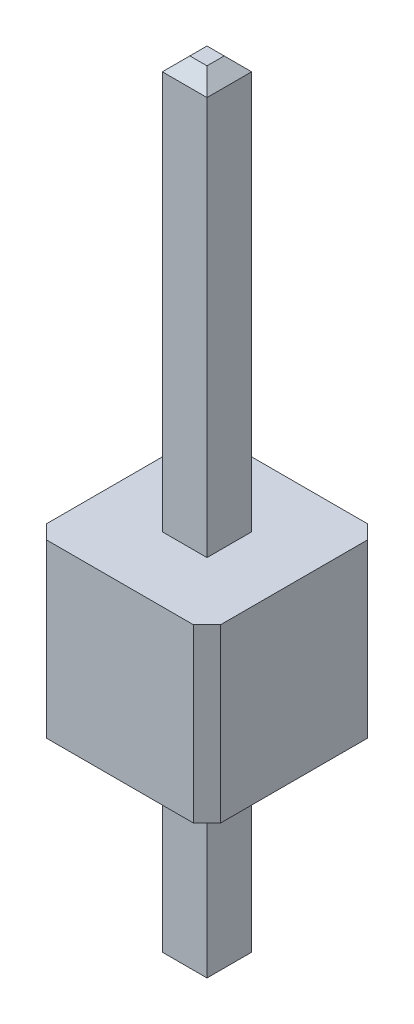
ISO-10303-21;
HEADER;
FILE_DESCRIPTION(('STEP AP214'),'2;1');
FILE_NAME('part.step','',(''),(''),'','','');
FILE_SCHEMA(('AUTOMOTIVE_DESIGN { 1 0 10303 214 1 1 1 1 }'));
ENDSEC;
DATA;
#1=APPLICATION_CONTEXT('core data for automotive mechanical design processes');
#2=APPLICATION_PROTOCOL_DEFINITION('international standard','automotive_design',2000,#1);
#3=PRODUCT_CONTEXT('',#1,'mechanical');
#4=PRODUCT('Part','Part','',(#3));
#5=PRODUCT_RELATED_PRODUCT_CATEGORY('part','',(#4));
#6=PRODUCT_DEFINITION_FORMATION('','',#4);
#7=PRODUCT_DEFINITION_CONTEXT('part definition',#1,'design');
#8=PRODUCT_DEFINITION('design','',#6,#7);
#9=PRODUCT_DEFINITION_SHAPE('','',#8);
#10=(LENGTH_UNIT() NAMED_UNIT(*) SI_UNIT(.MILLI.,.METRE.));
#11=(NAMED_UNIT(*) PLANE_ANGLE_UNIT() SI_UNIT($,.RADIAN.));
#12=(NAMED_UNIT(*) SI_UNIT($,.STERADIAN.) SOLID_ANGLE_UNIT());
#13=UNCERTAINTY_MEASURE_WITH_UNIT(LENGTH_MEASURE(1.E-05),#10,'distance_accuracy_value','');
#14=(GEOMETRIC_REPRESENTATION_CONTEXT(3) GLOBAL_UNCERTAINTY_ASSIGNED_CONTEXT((#13)) GLOBAL_UNIT_ASSIGNED_CONTEXT((#10,
#11,#12)) REPRESENTATION_CONTEXT('',''));
#15=CARTESIAN_POINT('',(0.,0.,0.));
#16=DIRECTION('',(0.,0.,1.));
#17=DIRECTION('',(1.,0.,0.));
#18=AXIS2_PLACEMENT_3D('',#15,#16,#17);
#19=CARTESIAN_POINT('',(1.27,2.5,1.27));
#20=DIRECTION('',(-1.,0.,0.));
#21=DIRECTION('',(0.,0.,1.));
#22=AXIS2_PLACEMENT_3D('',#19,#20,#21);
#23=PLANE('',#22);
#24=DIRECTION('',(0.,0.,-1.));
#25=VECTOR('',#24,1.);
#26=CARTESIAN_POINT('',(1.27,0.,1.27));
#27=LINE('',#26,#25);
#28=CARTESIAN_POINT('',(1.27,0.,1.07));
#29=VERTEX_POINT('',#28);
#30=CARTESIAN_POINT('',(1.27,0.,-1.07));
#31=VERTEX_POINT('',#30);
#32=EDGE_CURVE('E196',#29,#31,#27,.T.);
#33=ORIENTED_EDGE('',*,*,#32,.T.);
#34=DIRECTION('',(0.,1.,0.));
#35=VECTOR('',#34,1.);
#36=CARTESIAN_POINT('',(1.27,2.5,-1.07));
#37=LINE('',#36,#35);
#38=CARTESIAN_POINT('',(1.27,2.5,-1.07));
#39=VERTEX_POINT('',#38);
#40=EDGE_CURVE('E261',#31,#39,#37,.T.);
#41=ORIENTED_EDGE('',*,*,#40,.T.);
#42=DIRECTION('',(0.,0.,-1.));
#43=VECTOR('',#42,1.);
#44=CARTESIAN_POINT('',(1.27,2.5,1.27));
#45=LINE('',#44,#43);
#46=CARTESIAN_POINT('',(1.27,2.5,1.07));
#47=VERTEX_POINT('',#46);
#48=EDGE_CURVE('E197',#47,#39,#45,.T.);
#49=ORIENTED_EDGE('',*,*,#48,.F.);
#50=DIRECTION('',(0.,-1.,0.));
#51=VECTOR('',#50,1.);
#52=CARTESIAN_POINT('',(1.27,2.5,1.07));
#53=LINE('',#52,#51);
#54=EDGE_CURVE('E258',#47,#29,#53,.T.);
#55=ORIENTED_EDGE('',*,*,#54,.T.);
#56=EDGE_LOOP('',(#33,#41,#49,#55));
#57=FACE_BOUND('',#56,.T.);
#58=ADVANCED_FACE('F33',(#57),#23,.F.);
#59=CARTESIAN_POINT('',(-1.27,2.5,-1.27));
#60=DIRECTION('',(0.,0.,1.));
#61=DIRECTION('',(1.,0.,0.));
#62=AXIS2_PLACEMENT_3D('',#59,#60,#61);
#63=PLANE('',#62);
#64=DIRECTION('',(-1.,0.,0.));
#65=VECTOR('',#64,1.);
#66=CARTESIAN_POINT('',(-1.27,0.,-1.27));
#67=LINE('',#66,#65);
#68=CARTESIAN_POINT('',(1.07,0.,-1.27));
#69=VERTEX_POINT('',#68);
#70=CARTESIAN_POINT('',(-1.07,0.,-1.27));
#71=VERTEX_POINT('',#70);
#72=EDGE_CURVE('E213',#69,#71,#67,.T.);
#73=ORIENTED_EDGE('',*,*,#72,.T.);
#74=DIRECTION('',(0.,1.,0.));
#75=VECTOR('',#74,1.);
#76=CARTESIAN_POINT('',(-1.07,2.5,-1.27));
#77=LINE('',#76,#75);
#78=CARTESIAN_POINT('',(-1.07,2.5,-1.27));
#79=VERTEX_POINT('',#78);
#80=EDGE_CURVE('E248',#71,#79,#77,.T.);
#81=ORIENTED_EDGE('',*,*,#80,.T.);
#82=DIRECTION('',(-1.,0.,0.));
#83=VECTOR('',#82,1.);
#84=CARTESIAN_POINT('',(-1.27,2.5,-1.27));
#85=LINE('',#84,#83);
#86=CARTESIAN_POINT('',(1.07,2.5,-1.27));
#87=VERTEX_POINT('',#86);
#88=EDGE_CURVE('E200',#87,#79,#85,.T.);
#89=ORIENTED_EDGE('',*,*,#88,.F.);
#90=DIRECTION('',(0.,-1.,0.));
#91=VECTOR('',#90,1.);
#92=CARTESIAN_POINT('',(1.07,2.5,-1.27));
#93=LINE('',#92,#91);
#94=EDGE_CURVE('E245',#87,#69,#93,.T.);
#95=ORIENTED_EDGE('',*,*,#94,.T.);
#96=EDGE_LOOP('',(#73,#81,#89,#95));
#97=FACE_BOUND('',#96,.T.);
#98=ADVANCED_FACE('F358',(#97),#63,.F.);
#99=CARTESIAN_POINT('',(-1.27,2.5,1.27));
#100=DIRECTION('',(1.,0.,0.));
#101=DIRECTION('',(0.,0.,-1.));
#102=AXIS2_PLACEMENT_3D('',#99,#100,#101);
#103=PLANE('',#102);
#104=DIRECTION('',(0.,0.,1.));
#105=VECTOR('',#104,1.);
#106=CARTESIAN_POINT('',(-1.27,2.5,1.27));
#107=LINE('',#106,#105);
#108=CARTESIAN_POINT('',(-1.27,2.5,-1.07));
#109=VERTEX_POINT('',#108);
#110=CARTESIAN_POINT('',(-1.27,2.5,1.07));
#111=VERTEX_POINT('',#110);
#112=EDGE_CURVE('E204',#109,#111,#107,.T.);
#113=ORIENTED_EDGE('',*,*,#112,.F.);
#114=DIRECTION('',(0.,-1.,0.));
#115=VECTOR('',#114,1.);
#116=CARTESIAN_POINT('',(-1.27,2.5,-1.07));
#117=LINE('',#116,#115);
#118=CARTESIAN_POINT('',(-1.27,0.,-1.07));
#119=VERTEX_POINT('',#118);
#120=EDGE_CURVE('E234',#109,#119,#117,.T.);
#121=ORIENTED_EDGE('',*,*,#120,.T.);
#122=DIRECTION('',(0.,0.,1.));
#123=VECTOR('',#122,1.);
#124=CARTESIAN_POINT('',(-1.27,0.,1.27));
#125=LINE('',#124,#123);
#126=CARTESIAN_POINT('',(-1.27,0.,1.07));
#127=VERTEX_POINT('',#126);
#128=EDGE_CURVE('E216',#119,#127,#125,.T.);
#129=ORIENTED_EDGE('',*,*,#128,.T.);
#130=DIRECTION('',(0.,1.,0.));
#131=VECTOR('',#130,1.);
#132=CARTESIAN_POINT('',(-1.27,2.5,1.07));
#133=LINE('',#132,#131);
#134=EDGE_CURVE('E232',#127,#111,#133,.T.);
#135=ORIENTED_EDGE('',*,*,#134,.T.);
#136=EDGE_LOOP('',(#113,#121,#129,#135));
#137=FACE_BOUND('',#136,.T.);
#138=ADVANCED_FACE('F364',(#137),#103,.F.);
#139=CARTESIAN_POINT('',(-1.27,2.5,1.27));
#140=DIRECTION('',(0.,0.,-1.));
#141=DIRECTION('',(-1.,0.,0.));
#142=AXIS2_PLACEMENT_3D('',#139,#140,#141);
#143=PLANE('',#142);
#144=DIRECTION('',(1.,0.,0.));
#145=VECTOR('',#144,1.);
#146=CARTESIAN_POINT('',(-1.27,2.5,1.27));
#147=LINE('',#146,#145);
#148=CARTESIAN_POINT('',(-1.07,2.5,1.27));
#149=VERTEX_POINT('',#148);
#150=CARTESIAN_POINT('',(1.07,2.5,1.27));
#151=VERTEX_POINT('',#150);
#152=EDGE_CURVE('E207',#149,#151,#147,.T.);
#153=ORIENTED_EDGE('',*,*,#152,.F.);
#154=DIRECTION('',(0.,-1.,0.));
#155=VECTOR('',#154,1.);
#156=CARTESIAN_POINT('',(-1.07,2.5,1.27));
#157=LINE('',#156,#155);
#158=CARTESIAN_POINT('',(-1.07,0.,1.27));
#159=VERTEX_POINT('',#158);
#160=EDGE_CURVE('E265',#149,#159,#157,.T.);
#161=ORIENTED_EDGE('',*,*,#160,.T.);
#162=DIRECTION('',(1.,0.,0.));
#163=VECTOR('',#162,1.);
#164=CARTESIAN_POINT('',(-1.27,0.,1.27));
#165=LINE('',#164,#163);
#166=CARTESIAN_POINT('',(1.07,0.,1.27));
#167=VERTEX_POINT('',#166);
#168=EDGE_CURVE('E201',#159,#167,#165,.T.);
#169=ORIENTED_EDGE('',*,*,#168,.T.);
#170=DIRECTION('',(0.,1.,0.));
#171=VECTOR('',#170,1.);
#172=CARTESIAN_POINT('',(1.07,2.5,1.27));
#173=LINE('',#172,#171);
#174=EDGE_CURVE('E263',#167,#151,#173,.T.);
#175=ORIENTED_EDGE('',*,*,#174,.T.);
#176=EDGE_LOOP('',(#153,#161,#169,#175));
#177=FACE_BOUND('',#176,.T.);
#178=ADVANCED_FACE('F461',(#177),#143,.F.);
#179=CARTESIAN_POINT('',(0.,2.5,0.));
#180=DIRECTION('',(0.,-1.,0.));
#181=DIRECTION('',(0.,0.,-1.));
#182=AXIS2_PLACEMENT_3D('',#179,#180,#181);
#183=PLANE('',#182);
#184=DIRECTION('',(1.,0.,0.));
#185=VECTOR('',#184,1.);
#186=CARTESIAN_POINT('',(0.,2.5,-0.325));
#187=LINE('',#186,#185);
#188=CARTESIAN_POINT('',(-0.325,2.5,-0.325));
#189=VERTEX_POINT('',#188);
#190=CARTESIAN_POINT('',(0.325,2.5,-0.325));
#191=VERTEX_POINT('',#190);
#192=EDGE_CURVE('E170',#189,#191,#187,.T.);
#193=ORIENTED_EDGE('',*,*,#192,.T.);
#194=DIRECTION('',(0.,0.,1.));
#195=VECTOR('',#194,1.);
#196=CARTESIAN_POINT('',(0.325,2.5,0.));
#197=LINE('',#196,#195);
#198=CARTESIAN_POINT('',(0.325,2.5,0.325));
#199=VERTEX_POINT('',#198);
#200=EDGE_CURVE('E191',#191,#199,#197,.T.);
#201=ORIENTED_EDGE('',*,*,#200,.T.);
#202=DIRECTION('',(-1.,0.,0.));
#203=VECTOR('',#202,1.);
#204=CARTESIAN_POINT('',(0.,2.5,0.325));
#205=LINE('',#204,#203);
#206=CARTESIAN_POINT('',(-0.325,2.5,0.325));
#207=VERTEX_POINT('',#206);
#208=EDGE_CURVE('E189',#199,#207,#205,.T.);
#209=ORIENTED_EDGE('',*,*,#208,.T.);
#210=DIRECTION('',(0.,0.,-1.));
#211=VECTOR('',#210,1.);
#212=CARTESIAN_POINT('',(-0.325,2.5,0.));
#213=LINE('',#212,#211);
#214=EDGE_CURVE('E178',#207,#189,#213,.T.);
#215=ORIENTED_EDGE('',*,*,#214,.T.);
#216=EDGE_LOOP('',(#193,#201,#209,#215));
#217=FACE_BOUND('',#216,.T.);
#218=ORIENTED_EDGE('',*,*,#88,.T.);
#219=DIRECTION('',(0.707106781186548,0.,-0.707106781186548));
#220=VECTOR('',#219,1.);
#221=CARTESIAN_POINT('',(-1.27,2.5,-1.07));
#222=LINE('',#221,#220);
#223=EDGE_CURVE('E256',#79,#109,#222,.F.);
#224=ORIENTED_EDGE('',*,*,#223,.T.);
#225=ORIENTED_EDGE('',*,*,#112,.T.);
#226=DIRECTION('',(-0.707106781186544,0.,-0.707106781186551));
#227=VECTOR('',#226,1.);
#228=CARTESIAN_POINT('',(-1.07,2.5,1.27));
#229=LINE('',#228,#227);
#230=EDGE_CURVE('E252',#111,#149,#229,.F.);
#231=ORIENTED_EDGE('',*,*,#230,.T.);
#232=ORIENTED_EDGE('',*,*,#152,.T.);
#233=DIRECTION('',(-0.707106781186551,0.,0.707106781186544));
#234=VECTOR('',#233,1.);
#235=CARTESIAN_POINT('',(1.27,2.5,1.07));
#236=LINE('',#235,#234);
#237=EDGE_CURVE('E250',#151,#47,#236,.F.);
#238=ORIENTED_EDGE('',*,*,#237,.T.);
#239=ORIENTED_EDGE('',*,*,#48,.T.);
#240=DIRECTION('',(0.707106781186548,0.,0.707106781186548));
#241=VECTOR('',#240,1.);
#242=CARTESIAN_POINT('',(1.07,2.5,-1.27));
#243=LINE('',#242,#241);
#244=EDGE_CURVE('E254',#39,#87,#243,.F.);
#245=ORIENTED_EDGE('',*,*,#244,.T.);
#246=EDGE_LOOP('',(#218,#224,#225,#231,#232,#238,#239,#245));
#247=FACE_BOUND('',#246,.T.);
#248=ADVANCED_FACE('F187',(#217,#247),#183,.F.);
#249=CARTESIAN_POINT('',(0.,0.,0.));
#250=DIRECTION('',(0.,-1.,0.));
#251=DIRECTION('',(0.,0.,-1.));
#252=AXIS2_PLACEMENT_3D('',#249,#250,#251);
#253=PLANE('',#252);
#254=DIRECTION('',(0.,0.,1.));
#255=VECTOR('',#254,1.);
#256=CARTESIAN_POINT('',(0.325,0.,0.));
#257=LINE('',#256,#255);
#258=CARTESIAN_POINT('',(0.325,0.,-0.325));
#259=VERTEX_POINT('',#258);
#260=CARTESIAN_POINT('',(0.325,0.,0.325));
#261=VERTEX_POINT('',#260);
#262=EDGE_CURVE('E229',#259,#261,#257,.T.);
#263=ORIENTED_EDGE('',*,*,#262,.F.);
#264=DIRECTION('',(1.,0.,0.));
#265=VECTOR('',#264,1.);
#266=CARTESIAN_POINT('',(0.,0.,-0.325));
#267=LINE('',#266,#265);
#268=CARTESIAN_POINT('',(-0.325,0.,-0.325));
#269=VERTEX_POINT('',#268);
#270=EDGE_CURVE('E210',#269,#259,#267,.T.);
#271=ORIENTED_EDGE('',*,*,#270,.F.);
#272=DIRECTION('',(0.,0.,-1.));
#273=VECTOR('',#272,1.);
#274=CARTESIAN_POINT('',(-0.325,0.,0.));
#275=LINE('',#274,#273);
#276=CARTESIAN_POINT('',(-0.325,0.,0.325));
#277=VERTEX_POINT('',#276);
#278=EDGE_CURVE('E223',#277,#269,#275,.T.);
#279=ORIENTED_EDGE('',*,*,#278,.F.);
#280=DIRECTION('',(-1.,0.,0.));
#281=VECTOR('',#280,1.);
#282=CARTESIAN_POINT('',(0.,0.,0.325));
#283=LINE('',#282,#281);
#284=EDGE_CURVE('E226',#261,#277,#283,.T.);
#285=ORIENTED_EDGE('',*,*,#284,.F.);
#286=EDGE_LOOP('',(#263,#271,#279,#285));
#287=FACE_BOUND('',#286,.T.);
#288=ORIENTED_EDGE('',*,*,#128,.F.);
#289=DIRECTION('',(-0.707106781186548,0.,0.707106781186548));
#290=VECTOR('',#289,1.);
#291=CARTESIAN_POINT('',(-1.17,0.,-1.17));
#292=LINE('',#291,#290);
#293=EDGE_CURVE('E243',#119,#71,#292,.F.);
#294=ORIENTED_EDGE('',*,*,#293,.T.);
#295=ORIENTED_EDGE('',*,*,#72,.F.);
#296=DIRECTION('',(-0.707106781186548,0.,-0.707106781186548));
#297=VECTOR('',#296,1.);
#298=CARTESIAN_POINT('',(1.17,0.,-1.17));
#299=LINE('',#298,#297);
#300=EDGE_CURVE('E241',#69,#31,#299,.F.);
#301=ORIENTED_EDGE('',*,*,#300,.T.);
#302=ORIENTED_EDGE('',*,*,#32,.F.);
#303=DIRECTION('',(0.707106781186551,0.,-0.707106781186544));
#304=VECTOR('',#303,1.);
#305=CARTESIAN_POINT('',(1.16999999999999,0.,1.17));
#306=LINE('',#305,#304);
#307=EDGE_CURVE('E237',#29,#167,#306,.F.);
#308=ORIENTED_EDGE('',*,*,#307,.T.);
#309=ORIENTED_EDGE('',*,*,#168,.F.);
#310=DIRECTION('',(0.707106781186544,0.,0.707106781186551));
#311=VECTOR('',#310,1.);
#312=CARTESIAN_POINT('',(-1.17,0.,1.16999999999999));
#313=LINE('',#312,#311);
#314=EDGE_CURVE('E239',#159,#127,#313,.F.);
#315=ORIENTED_EDGE('',*,*,#314,.T.);
#316=EDGE_LOOP('',(#288,#294,#295,#301,#302,#308,#309,#315));
#317=FACE_BOUND('',#316,.T.);
#318=ADVANCED_FACE('F444',(#287,#317),#253,.T.);
#319=CARTESIAN_POINT('',(0.,-3.,0.));
#320=DIRECTION('',(0.,-1.,0.));
#321=DIRECTION('',(0.,0.,-1.));
#322=AXIS2_PLACEMENT_3D('',#319,#320,#321);
#323=PLANE('',#322);
#324=DIRECTION('',(0.,0.,1.));
#325=VECTOR('',#324,1.);
#326=CARTESIAN_POINT('',(0.125,-3.,0.));
#327=LINE('',#326,#325);
#328=CARTESIAN_POINT('',(0.125,-3.,-0.125));
#329=VERTEX_POINT('',#328);
#330=CARTESIAN_POINT('',(0.125,-3.,0.124999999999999));
#331=VERTEX_POINT('',#330);
#332=EDGE_CURVE('E271',#329,#331,#327,.T.);
#333=ORIENTED_EDGE('',*,*,#332,.T.);
#334=DIRECTION('',(-1.,0.,0.));
#335=VECTOR('',#334,1.);
#336=CARTESIAN_POINT('',(0.,-3.,0.124999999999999));
#337=LINE('',#336,#335);
#338=CARTESIAN_POINT('',(-0.124999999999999,-3.,0.124999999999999));
#339=VERTEX_POINT('',#338);
#340=EDGE_CURVE('E277',#331,#339,#337,.T.);
#341=ORIENTED_EDGE('',*,*,#340,.T.);
#342=DIRECTION('',(0.,0.,-1.));
#343=VECTOR('',#342,1.);
#344=CARTESIAN_POINT('',(-0.124999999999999,-3.,0.));
#345=LINE('',#344,#343);
#346=CARTESIAN_POINT('',(-0.124999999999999,-3.,-0.125));
#347=VERTEX_POINT('',#346);
#348=EDGE_CURVE('E275',#339,#347,#345,.T.);
#349=ORIENTED_EDGE('',*,*,#348,.T.);
#350=DIRECTION('',(1.,0.,0.));
#351=VECTOR('',#350,1.);
#352=CARTESIAN_POINT('',(0.,-3.,-0.125));
#353=LINE('',#352,#351);
#354=EDGE_CURVE('E273',#347,#329,#353,.T.);
#355=ORIENTED_EDGE('',*,*,#354,.T.);
#356=EDGE_LOOP('',(#333,#341,#349,#355));
#357=FACE_BOUND('',#356,.T.);
#358=ADVANCED_FACE('F449',(#357),#323,.T.);
#359=CARTESIAN_POINT('',(-0.325,-3.,-0.325));
#360=DIRECTION('',(0.,0.,-1.));
#361=DIRECTION('',(-1.,0.,0.));
#362=AXIS2_PLACEMENT_3D('',#359,#360,#361);
#363=PLANE('',#362);
#364=DIRECTION('',(0.,1.,0.));
#365=VECTOR('',#364,1.);
#366=CARTESIAN_POINT('',(0.325,-3.,-0.325));
#367=LINE('',#366,#365);
#368=CARTESIAN_POINT('',(0.325,-2.8,-0.325));
#369=VERTEX_POINT('',#368);
#370=EDGE_CURVE('E184',#369,#259,#367,.T.);
#371=ORIENTED_EDGE('',*,*,#370,.F.);
#372=DIRECTION('',(-1.,0.,0.));
#373=VECTOR('',#372,1.);
#374=CARTESIAN_POINT('',(-0.325,-2.8,-0.325));
#375=LINE('',#374,#373);
#376=CARTESIAN_POINT('',(-0.325,-2.8,-0.325));
#377=VERTEX_POINT('',#376);
#378=EDGE_CURVE('E282',#369,#377,#375,.T.);
#379=ORIENTED_EDGE('',*,*,#378,.T.);
#380=DIRECTION('',(0.,1.,0.));
#381=VECTOR('',#380,1.);
#382=CARTESIAN_POINT('',(-0.325,-3.,-0.325));
#383=LINE('',#382,#381);
#384=EDGE_CURVE('E183',#377,#269,#383,.T.);
#385=ORIENTED_EDGE('',*,*,#384,.T.);
#386=ORIENTED_EDGE('',*,*,#270,.T.);
#387=EDGE_LOOP('',(#371,#379,#385,#386));
#388=FACE_BOUND('',#387,.T.);
#389=ADVANCED_FACE('F355',(#388),#363,.T.);
#390=CARTESIAN_POINT('',(-0.325,-3.,0.325));
#391=DIRECTION('',(-1.,0.,0.));
#392=DIRECTION('',(0.,0.,1.));
#393=AXIS2_PLACEMENT_3D('',#390,#391,#392);
#394=PLANE('',#393);
#395=ORIENTED_EDGE('',*,*,#384,.F.);
#396=DIRECTION('',(0.,0.,1.));
#397=VECTOR('',#396,1.);
#398=CARTESIAN_POINT('',(-0.325,-2.8,0.325));
#399=LINE('',#398,#397);
#400=CARTESIAN_POINT('',(-0.325,-2.8,0.325));
#401=VERTEX_POINT('',#400);
#402=EDGE_CURVE('E280',#377,#401,#399,.T.);
#403=ORIENTED_EDGE('',*,*,#402,.T.);
#404=DIRECTION('',(0.,1.,0.));
#405=VECTOR('',#404,1.);
#406=CARTESIAN_POINT('',(-0.325,-3.,0.325));
#407=LINE('',#406,#405);
#408=EDGE_CURVE('E337',#401,#277,#407,.T.);
#409=ORIENTED_EDGE('',*,*,#408,.T.);
#410=ORIENTED_EDGE('',*,*,#278,.T.);
#411=EDGE_LOOP('',(#395,#403,#409,#410));
#412=FACE_BOUND('',#411,.T.);
#413=ADVANCED_FACE('F500',(#412),#394,.T.);
#414=CARTESIAN_POINT('',(-0.325,-3.,0.325));
#415=DIRECTION('',(0.,0.,1.));
#416=DIRECTION('',(1.,0.,0.));
#417=AXIS2_PLACEMENT_3D('',#414,#415,#416);
#418=PLANE('',#417);
#419=ORIENTED_EDGE('',*,*,#408,.F.);
#420=DIRECTION('',(1.,0.,0.));
#421=VECTOR('',#420,1.);
#422=CARTESIAN_POINT('',(-0.325,-2.8,0.325));
#423=LINE('',#422,#421);
#424=CARTESIAN_POINT('',(0.325,-2.8,0.325));
#425=VERTEX_POINT('',#424);
#426=EDGE_CURVE('E268',#401,#425,#423,.T.);
#427=ORIENTED_EDGE('',*,*,#426,.T.);
#428=DIRECTION('',(0.,1.,0.));
#429=VECTOR('',#428,1.);
#430=CARTESIAN_POINT('',(0.325,-3.,0.325));
#431=LINE('',#430,#429);
#432=EDGE_CURVE('E179',#425,#261,#431,.T.);
#433=ORIENTED_EDGE('',*,*,#432,.T.);
#434=ORIENTED_EDGE('',*,*,#284,.T.);
#435=EDGE_LOOP('',(#419,#427,#433,#434));
#436=FACE_BOUND('',#435,.T.);
#437=ADVANCED_FACE('F496',(#436),#418,.T.);
#438=CARTESIAN_POINT('',(0.325,-3.,0.325));
#439=DIRECTION('',(1.,0.,0.));
#440=DIRECTION('',(0.,0.,-1.));
#441=AXIS2_PLACEMENT_3D('',#438,#439,#440);
#442=PLANE('',#441);
#443=ORIENTED_EDGE('',*,*,#432,.F.);
#444=DIRECTION('',(0.,0.,-1.));
#445=VECTOR('',#444,1.);
#446=CARTESIAN_POINT('',(0.325,-2.8,0.325));
#447=LINE('',#446,#445);
#448=EDGE_CURVE('E284',#425,#369,#447,.T.);
#449=ORIENTED_EDGE('',*,*,#448,.T.);
#450=ORIENTED_EDGE('',*,*,#370,.T.);
#451=ORIENTED_EDGE('',*,*,#262,.T.);
#452=EDGE_LOOP('',(#443,#449,#450,#451));
#453=FACE_BOUND('',#452,.T.);
#454=ADVANCED_FACE('F494',(#453),#442,.T.);
#455=CARTESIAN_POINT('',(0.325,8.3,-0.325));
#456=VERTEX_POINT('',#455);
#457=EDGE_CURVE('E173',#191,#456,#367,.T.);
#458=ORIENTED_EDGE('',*,*,#457,.T.);
#459=DIRECTION('',(0.,0.,1.));
#460=VECTOR('',#459,1.);
#461=CARTESIAN_POINT('',(0.325,8.3,0.325));
#462=LINE('',#461,#460);
#463=CARTESIAN_POINT('',(0.325,8.3,0.325));
#464=VERTEX_POINT('',#463);
#465=EDGE_CURVE('E11',#456,#464,#462,.T.);
#466=ORIENTED_EDGE('',*,*,#465,.T.);
#467=EDGE_CURVE('E333',#199,#464,#431,.T.);
#468=ORIENTED_EDGE('',*,*,#467,.F.);
#469=ORIENTED_EDGE('',*,*,#200,.F.);
#470=EDGE_LOOP('',(#458,#466,#468,#469));
#471=FACE_BOUND('',#470,.T.);
#472=ADVANCED_FACE('F332',(#471),#442,.T.);
#473=ORIENTED_EDGE('',*,*,#467,.T.);
#474=DIRECTION('',(-1.,0.,0.));
#475=VECTOR('',#474,1.);
#476=CARTESIAN_POINT('',(-0.325,8.3,0.325));
#477=LINE('',#476,#475);
#478=CARTESIAN_POINT('',(-0.325,8.3,0.325));
#479=VERTEX_POINT('',#478);
#480=EDGE_CURVE('E295',#464,#479,#477,.T.);
#481=ORIENTED_EDGE('',*,*,#480,.T.);
#482=EDGE_CURVE('E524',#207,#479,#407,.T.);
#483=ORIENTED_EDGE('',*,*,#482,.F.);
#484=ORIENTED_EDGE('',*,*,#208,.F.);
#485=EDGE_LOOP('',(#473,#481,#483,#484));
#486=FACE_BOUND('',#485,.T.);
#487=ADVANCED_FACE('F336',(#486),#418,.T.);
#488=ORIENTED_EDGE('',*,*,#482,.T.);
#489=DIRECTION('',(0.,0.,-1.));
#490=VECTOR('',#489,1.);
#491=CARTESIAN_POINT('',(-0.325,8.3,-0.325));
#492=LINE('',#491,#490);
#493=CARTESIAN_POINT('',(-0.325,8.3,-0.325));
#494=VERTEX_POINT('',#493);
#495=EDGE_CURVE('E57',#479,#494,#492,.T.);
#496=ORIENTED_EDGE('',*,*,#495,.T.);
#497=EDGE_CURVE('E172',#189,#494,#383,.T.);
#498=ORIENTED_EDGE('',*,*,#497,.F.);
#499=ORIENTED_EDGE('',*,*,#214,.F.);
#500=EDGE_LOOP('',(#488,#496,#498,#499));
#501=FACE_BOUND('',#500,.T.);
#502=ADVANCED_FACE('F181',(#501),#394,.T.);
#503=ORIENTED_EDGE('',*,*,#497,.T.);
#504=DIRECTION('',(1.,0.,0.));
#505=VECTOR('',#504,1.);
#506=CARTESIAN_POINT('',(0.325,8.3,-0.325));
#507=LINE('',#506,#505);
#508=EDGE_CURVE('E42',#494,#456,#507,.T.);
#509=ORIENTED_EDGE('',*,*,#508,.T.);
#510=ORIENTED_EDGE('',*,*,#457,.F.);
#511=ORIENTED_EDGE('',*,*,#192,.F.);
#512=EDGE_LOOP('',(#503,#509,#510,#511));
#513=FACE_BOUND('',#512,.T.);
#514=ADVANCED_FACE('F171',(#513),#363,.T.);
#515=CARTESIAN_POINT('',(0.,8.5,0.));
#516=DIRECTION('',(0.,-1.,0.));
#517=DIRECTION('',(0.,0.,-1.));
#518=AXIS2_PLACEMENT_3D('',#515,#516,#517);
#519=PLANE('',#518);
#520=DIRECTION('',(0.,0.,1.));
#521=VECTOR('',#520,1.);
#522=CARTESIAN_POINT('',(-0.124999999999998,8.5,0.325));
#523=LINE('',#522,#521);
#524=CARTESIAN_POINT('',(-0.124999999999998,8.5,-0.124999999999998));
#525=VERTEX_POINT('',#524);
#526=CARTESIAN_POINT('',(-0.124999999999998,8.5,0.124999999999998));
#527=VERTEX_POINT('',#526);
#528=EDGE_CURVE('E290',#525,#527,#523,.T.);
#529=ORIENTED_EDGE('',*,*,#528,.T.);
#530=DIRECTION('',(1.,0.,0.));
#531=VECTOR('',#530,1.);
#532=CARTESIAN_POINT('',(0.325,8.5,0.124999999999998));
#533=LINE('',#532,#531);
#534=CARTESIAN_POINT('',(0.124999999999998,8.5,0.124999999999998));
#535=VERTEX_POINT('',#534);
#536=EDGE_CURVE('E292',#527,#535,#533,.T.);
#537=ORIENTED_EDGE('',*,*,#536,.T.);
#538=DIRECTION('',(0.,0.,-1.));
#539=VECTOR('',#538,1.);
#540=CARTESIAN_POINT('',(0.124999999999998,8.5,-0.325));
#541=LINE('',#540,#539);
#542=CARTESIAN_POINT('',(0.124999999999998,8.5,-0.124999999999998));
#543=VERTEX_POINT('',#542);
#544=EDGE_CURVE('E286',#535,#543,#541,.T.);
#545=ORIENTED_EDGE('',*,*,#544,.T.);
#546=DIRECTION('',(-1.,0.,0.));
#547=VECTOR('',#546,1.);
#548=CARTESIAN_POINT('',(-0.325,8.5,-0.124999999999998));
#549=LINE('',#548,#547);
#550=EDGE_CURVE('E288',#543,#525,#549,.T.);
#551=ORIENTED_EDGE('',*,*,#550,.T.);
#552=EDGE_LOOP('',(#529,#537,#545,#551));
#553=FACE_BOUND('',#552,.T.);
#554=ADVANCED_FACE('F343',(#553),#519,.F.);
#555=CARTESIAN_POINT('',(-1.27,2.5,-1.07));
#556=DIRECTION('',(0.707106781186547,0.,0.707106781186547));
#557=DIRECTION('',(0.,-1.,0.));
#558=AXIS2_PLACEMENT_3D('',#555,#556,#557);
#559=PLANE('',#558);
#560=ORIENTED_EDGE('',*,*,#223,.F.);
#561=ORIENTED_EDGE('',*,*,#80,.F.);
#562=ORIENTED_EDGE('',*,*,#293,.F.);
#563=ORIENTED_EDGE('',*,*,#120,.F.);
#564=EDGE_LOOP('',(#560,#561,#562,#563));
#565=FACE_BOUND('',#564,.T.);
#566=ADVANCED_FACE('F345',(#565),#559,.F.);
#567=CARTESIAN_POINT('',(1.07,2.5,-1.27));
#568=DIRECTION('',(-0.707106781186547,0.,0.707106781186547));
#569=DIRECTION('',(0.,-1.,0.));
#570=AXIS2_PLACEMENT_3D('',#567,#568,#569);
#571=PLANE('',#570);
#572=ORIENTED_EDGE('',*,*,#244,.F.);
#573=ORIENTED_EDGE('',*,*,#40,.F.);
#574=ORIENTED_EDGE('',*,*,#300,.F.);
#575=ORIENTED_EDGE('',*,*,#94,.F.);
#576=EDGE_LOOP('',(#572,#573,#574,#575));
#577=FACE_BOUND('',#576,.T.);
#578=ADVANCED_FACE('F351',(#577),#571,.F.);
#579=CARTESIAN_POINT('',(-1.07,2.5,1.27));
#580=DIRECTION('',(0.707106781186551,0.,-0.707106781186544));
#581=DIRECTION('',(0.,-1.,0.));
#582=AXIS2_PLACEMENT_3D('',#579,#580,#581);
#583=PLANE('',#582);
#584=ORIENTED_EDGE('',*,*,#230,.F.);
#585=ORIENTED_EDGE('',*,*,#134,.F.);
#586=ORIENTED_EDGE('',*,*,#314,.F.);
#587=ORIENTED_EDGE('',*,*,#160,.F.);
#588=EDGE_LOOP('',(#584,#585,#586,#587));
#589=FACE_BOUND('',#588,.T.);
#590=ADVANCED_FACE('F371',(#589),#583,.F.);
#591=CARTESIAN_POINT('',(1.27,2.5,1.07));
#592=DIRECTION('',(-0.707106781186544,0.,-0.707106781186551));
#593=DIRECTION('',(0.,-1.,0.));
#594=AXIS2_PLACEMENT_3D('',#591,#592,#593);
#595=PLANE('',#594);
#596=ORIENTED_EDGE('',*,*,#237,.F.);
#597=ORIENTED_EDGE('',*,*,#174,.F.);
#598=ORIENTED_EDGE('',*,*,#307,.F.);
#599=ORIENTED_EDGE('',*,*,#54,.F.);
#600=EDGE_LOOP('',(#596,#597,#598,#599));
#601=FACE_BOUND('',#600,.T.);
#602=ADVANCED_FACE('F375',(#601),#595,.F.);
#603=CARTESIAN_POINT('',(-0.325,-2.8,-0.325));
#604=DIRECTION('',(0.,0.707106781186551,0.707106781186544));
#605=DIRECTION('',(-1.,0.,0.));
#606=AXIS2_PLACEMENT_3D('',#603,#604,#605);
#607=PLANE('',#606);
#608=DIRECTION('',(0.577350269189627,0.577350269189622,-0.577350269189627));
#609=VECTOR('',#608,1.);
#610=CARTESIAN_POINT('',(0.108333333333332,-3.01666666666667,-0.108333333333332));
#611=LINE('',#610,#609);
#612=EDGE_CURVE('E304',#329,#369,#611,.T.);
#613=ORIENTED_EDGE('',*,*,#612,.F.);
#614=ORIENTED_EDGE('',*,*,#354,.F.);
#615=DIRECTION('',(-0.577350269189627,0.577350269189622,-0.577350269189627));
#616=VECTOR('',#615,1.);
#617=CARTESIAN_POINT('',(-0.325,-2.8,-0.325));
#618=LINE('',#617,#616);
#619=EDGE_CURVE('E307',#377,#347,#618,.F.);
#620=ORIENTED_EDGE('',*,*,#619,.F.);
#621=ORIENTED_EDGE('',*,*,#378,.F.);
#622=EDGE_LOOP('',(#613,#614,#620,#621));
#623=FACE_BOUND('',#622,.T.);
#624=ADVANCED_FACE('F379',(#623),#607,.F.);
#625=CARTESIAN_POINT('',(-0.325,-2.8,0.325));
#626=DIRECTION('',(0.707106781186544,0.707106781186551,0.));
#627=DIRECTION('',(0.,0.,1.));
#628=AXIS2_PLACEMENT_3D('',#625,#626,#627);
#629=PLANE('',#628);
#630=ORIENTED_EDGE('',*,*,#619,.T.);
#631=ORIENTED_EDGE('',*,*,#348,.F.);
#632=DIRECTION('',(-0.577350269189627,0.577350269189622,0.577350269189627));
#633=VECTOR('',#632,1.);
#634=CARTESIAN_POINT('',(-0.325,-2.8,0.325));
#635=LINE('',#634,#633);
#636=EDGE_CURVE('E302',#401,#339,#635,.F.);
#637=ORIENTED_EDGE('',*,*,#636,.F.);
#638=ORIENTED_EDGE('',*,*,#402,.F.);
#639=EDGE_LOOP('',(#630,#631,#637,#638));
#640=FACE_BOUND('',#639,.T.);
#641=ADVANCED_FACE('F388',(#640),#629,.F.);
#642=CARTESIAN_POINT('',(0.325,-2.8,0.325));
#643=DIRECTION('',(-0.707106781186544,0.707106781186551,0.));
#644=DIRECTION('',(0.,0.,-1.));
#645=AXIS2_PLACEMENT_3D('',#642,#643,#644);
#646=PLANE('',#645);
#647=ORIENTED_EDGE('',*,*,#612,.T.);
#648=ORIENTED_EDGE('',*,*,#448,.F.);
#649=DIRECTION('',(-0.577350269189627,-0.577350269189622,-0.577350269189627));
#650=VECTOR('',#649,1.);
#651=CARTESIAN_POINT('',(0.325,-2.8,0.325));
#652=LINE('',#651,#650);
#653=EDGE_CURVE('E300',#331,#425,#652,.F.);
#654=ORIENTED_EDGE('',*,*,#653,.F.);
#655=ORIENTED_EDGE('',*,*,#332,.F.);
#656=EDGE_LOOP('',(#647,#648,#654,#655));
#657=FACE_BOUND('',#656,.T.);
#658=ADVANCED_FACE('F384',(#657),#646,.F.);
#659=CARTESIAN_POINT('',(-0.325,-2.8,0.325));
#660=DIRECTION('',(0.,0.707106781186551,-0.707106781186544));
#661=DIRECTION('',(1.,0.,0.));
#662=AXIS2_PLACEMENT_3D('',#659,#660,#661);
#663=PLANE('',#662);
#664=ORIENTED_EDGE('',*,*,#636,.T.);
#665=ORIENTED_EDGE('',*,*,#340,.F.);
#666=ORIENTED_EDGE('',*,*,#653,.T.);
#667=ORIENTED_EDGE('',*,*,#426,.F.);
#668=EDGE_LOOP('',(#664,#665,#666,#667));
#669=FACE_BOUND('',#668,.T.);
#670=ADVANCED_FACE('F381',(#669),#663,.F.);
#671=CARTESIAN_POINT('',(0.,8.5,-0.124999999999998));
#672=DIRECTION('',(0.,0.707106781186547,-0.707106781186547));
#673=DIRECTION('',(1.,0.,0.));
#674=AXIS2_PLACEMENT_3D('',#671,#672,#673);
#675=PLANE('',#674);
#676=DIRECTION('',(-0.577350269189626,0.577350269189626,0.577350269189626));
#677=VECTOR('',#676,1.);
#678=CARTESIAN_POINT('',(0.0833333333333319,8.54166666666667,-0.0833333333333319));
#679=LINE('',#678,#677);
#680=EDGE_CURVE('E313',#456,#543,#679,.T.);
#681=ORIENTED_EDGE('',*,*,#680,.F.);
#682=ORIENTED_EDGE('',*,*,#508,.F.);
#683=DIRECTION('',(0.577350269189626,0.577350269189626,0.577350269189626));
#684=VECTOR('',#683,1.);
#685=CARTESIAN_POINT('',(-0.0833333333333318,8.54166666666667,-0.083333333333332));
#686=LINE('',#685,#684);
#687=EDGE_CURVE('E37',#525,#494,#686,.F.);
#688=ORIENTED_EDGE('',*,*,#687,.F.);
#689=ORIENTED_EDGE('',*,*,#550,.F.);
#690=EDGE_LOOP('',(#681,#682,#688,#689));
#691=FACE_BOUND('',#690,.T.);
#692=ADVANCED_FACE('F35',(#691),#675,.T.);
#693=CARTESIAN_POINT('',(-0.124999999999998,8.5,0.));
#694=DIRECTION('',(-0.707106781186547,0.707106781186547,0.));
#695=DIRECTION('',(0.,0.,-1.));
#696=AXIS2_PLACEMENT_3D('',#693,#694,#695);
#697=PLANE('',#696);
#698=ORIENTED_EDGE('',*,*,#687,.T.);
#699=ORIENTED_EDGE('',*,*,#495,.F.);
#700=DIRECTION('',(0.577350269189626,0.577350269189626,-0.577350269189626));
#701=VECTOR('',#700,1.);
#702=CARTESIAN_POINT('',(-0.0833333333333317,8.54166666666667,0.0833333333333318));
#703=LINE('',#702,#701);
#704=EDGE_CURVE('E312',#527,#479,#703,.F.);
#705=ORIENTED_EDGE('',*,*,#704,.F.);
#706=ORIENTED_EDGE('',*,*,#528,.F.);
#707=EDGE_LOOP('',(#698,#699,#705,#706));
#708=FACE_BOUND('',#707,.T.);
#709=ADVANCED_FACE('F323',(#708),#697,.T.);
#710=CARTESIAN_POINT('',(0.124999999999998,8.5,0.));
#711=DIRECTION('',(0.707106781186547,0.707106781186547,0.));
#712=DIRECTION('',(0.,0.,1.));
#713=AXIS2_PLACEMENT_3D('',#710,#711,#712);
#714=PLANE('',#713);
#715=ORIENTED_EDGE('',*,*,#680,.T.);
#716=ORIENTED_EDGE('',*,*,#544,.F.);
#717=DIRECTION('',(0.577350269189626,-0.577350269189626,0.577350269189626));
#718=VECTOR('',#717,1.);
#719=CARTESIAN_POINT('',(0.083333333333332,8.54166666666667,0.0833333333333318));
#720=LINE('',#719,#718);
#721=EDGE_CURVE('E310',#464,#535,#720,.F.);
#722=ORIENTED_EDGE('',*,*,#721,.F.);
#723=ORIENTED_EDGE('',*,*,#465,.F.);
#724=EDGE_LOOP('',(#715,#716,#722,#723));
#725=FACE_BOUND('',#724,.T.);
#726=ADVANCED_FACE('F328',(#725),#714,.T.);
#727=CARTESIAN_POINT('',(0.,8.5,0.124999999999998));
#728=DIRECTION('',(0.,0.707106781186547,0.707106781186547));
#729=DIRECTION('',(-1.,0.,0.));
#730=AXIS2_PLACEMENT_3D('',#727,#728,#729);
#731=PLANE('',#730);
#732=ORIENTED_EDGE('',*,*,#704,.T.);
#733=ORIENTED_EDGE('',*,*,#480,.F.);
#734=ORIENTED_EDGE('',*,*,#721,.T.);
#735=ORIENTED_EDGE('',*,*,#536,.F.);
#736=EDGE_LOOP('',(#732,#733,#734,#735));
#737=FACE_BOUND('',#736,.T.);
#738=ADVANCED_FACE('F340',(#737),#731,.T.);
#739=CLOSED_SHELL('',(#58,#98,#138,#178,#248,#318,#358,#389,#413,#437,#454,#472,#487,#502,#514,
#554,#566,#578,#590,#602,#624,#641,#658,#670,#692,#709,#726,#738));
#740=MANIFOLD_SOLID_BREP('B2',#739);
#741=ADVANCED_BREP_SHAPE_REPRESENTATION('',(#18,#740),#14);
#742=SHAPE_DEFINITION_REPRESENTATION(#9,#741);
ENDSEC;
END-ISO-10303-21;
